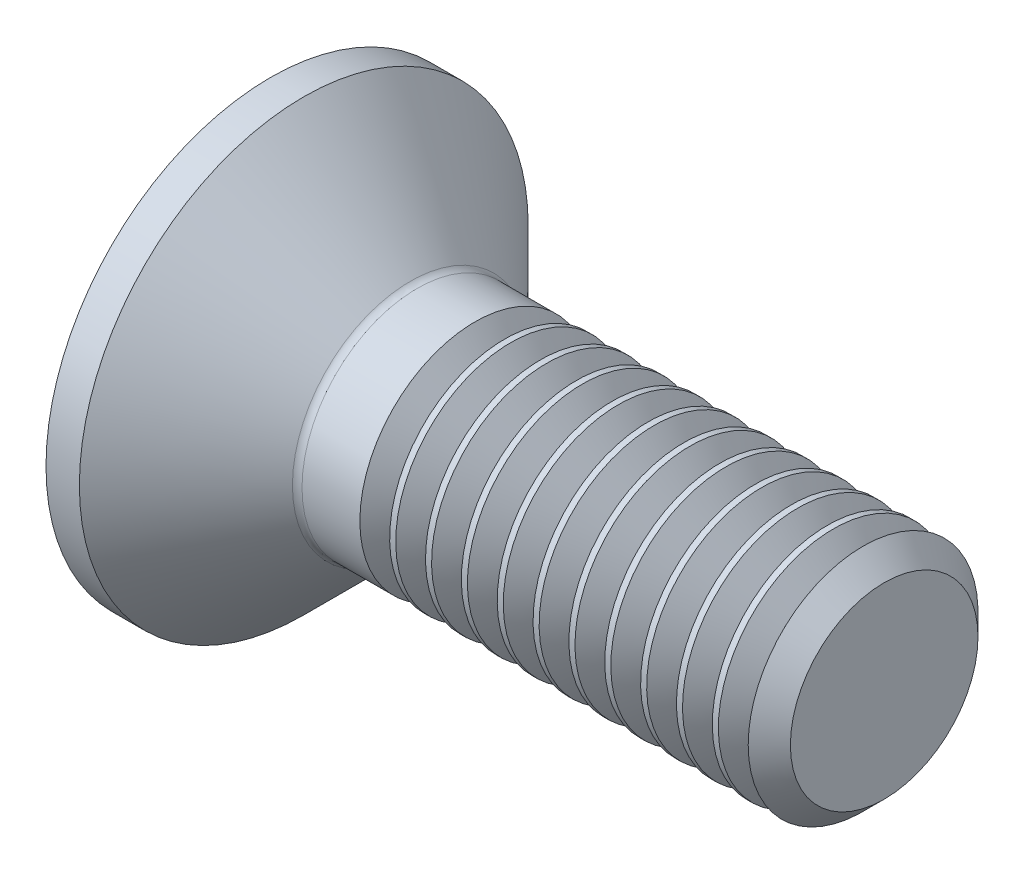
ISO-10303-21;
HEADER;
FILE_DESCRIPTION(('STEP AP214'),'2;1');
FILE_NAME('part.step','',(''),(''),'','','');
FILE_SCHEMA(('AUTOMOTIVE_DESIGN { 1 0 10303 214 1 1 1 1 }'));
ENDSEC;
DATA;
#1=APPLICATION_CONTEXT('core data for automotive mechanical design processes');
#2=APPLICATION_PROTOCOL_DEFINITION('international standard','automotive_design',2000,#1);
#3=PRODUCT_CONTEXT('',#1,'mechanical');
#4=PRODUCT('Part','Part','',(#3));
#5=PRODUCT_RELATED_PRODUCT_CATEGORY('part','',(#4));
#6=PRODUCT_DEFINITION_FORMATION('','',#4);
#7=PRODUCT_DEFINITION_CONTEXT('part definition',#1,'design');
#8=PRODUCT_DEFINITION('design','',#6,#7);
#9=PRODUCT_DEFINITION_SHAPE('','',#8);
#10=(LENGTH_UNIT() NAMED_UNIT(*) SI_UNIT(.MILLI.,.METRE.));
#11=(NAMED_UNIT(*) PLANE_ANGLE_UNIT() SI_UNIT($,.RADIAN.));
#12=(NAMED_UNIT(*) SI_UNIT($,.STERADIAN.) SOLID_ANGLE_UNIT());
#13=UNCERTAINTY_MEASURE_WITH_UNIT(LENGTH_MEASURE(1.E-05),#10,'distance_accuracy_value','');
#14=(GEOMETRIC_REPRESENTATION_CONTEXT(3) GLOBAL_UNCERTAINTY_ASSIGNED_CONTEXT((#13)) GLOBAL_UNIT_ASSIGNED_CONTEXT((#10,
#11,#12)) REPRESENTATION_CONTEXT('',''));
#15=CARTESIAN_POINT('',(0.,0.,0.));
#16=DIRECTION('',(0.,0.,1.));
#17=DIRECTION('',(1.,0.,0.));
#18=AXIS2_PLACEMENT_3D('',#15,#16,#17);
#19=CARTESIAN_POINT('',(0.,0.,0.));
#20=DIRECTION('',(-1.,0.,0.));
#21=DIRECTION('',(0.,0.,1.));
#22=AXIS2_PLACEMENT_3D('',#19,#20,#21);
#23=PLANE('',#22);
#24=CARTESIAN_POINT('',(0.,0.,0.));
#25=DIRECTION('',(-1.,0.,0.));
#26=DIRECTION('',(0.,0.,1.));
#27=AXIS2_PLACEMENT_3D('',#24,#25,#26);
#28=CIRCLE('',#27,5.85);
#29=CARTESIAN_POINT('',(0.,0.,5.85));
#30=VERTEX_POINT('',#29);
#31=EDGE_CURVE('E186',#30,#30,#28,.T.);
#32=ORIENTED_EDGE('',*,*,#31,.T.);
#33=EDGE_LOOP('',(#32));
#34=FACE_BOUND('',#33,.T.);
#35=DIRECTION('',(0.,-0.500000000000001,-0.866025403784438));
#36=VECTOR('',#35,1.);
#37=CARTESIAN_POINT('',(0.,-1.15470053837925,2.));
#38=LINE('',#37,#36);
#39=CARTESIAN_POINT('',(0.,-1.15470053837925,2.));
#40=VERTEX_POINT('',#39);
#41=CARTESIAN_POINT('',(0.,-2.3094010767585,0.));
#42=VERTEX_POINT('',#41);
#43=EDGE_CURVE('E130',#40,#42,#38,.T.);
#44=ORIENTED_EDGE('',*,*,#43,.T.);
#45=DIRECTION('',(0.,0.500000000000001,-0.866025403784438));
#46=VECTOR('',#45,1.);
#47=CARTESIAN_POINT('',(0.,-2.3094010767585,0.));
#48=LINE('',#47,#46);
#49=CARTESIAN_POINT('',(0.,-1.15470053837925,-2.));
#50=VERTEX_POINT('',#49);
#51=EDGE_CURVE('E48',#42,#50,#48,.T.);
#52=ORIENTED_EDGE('',*,*,#51,.T.);
#53=DIRECTION('',(0.,1.,0.));
#54=VECTOR('',#53,1.);
#55=CARTESIAN_POINT('',(0.,-1.15470053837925,-2.));
#56=LINE('',#55,#54);
#57=CARTESIAN_POINT('',(0.,1.15470053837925,-2.));
#58=VERTEX_POINT('',#57);
#59=EDGE_CURVE('E111',#50,#58,#56,.T.);
#60=ORIENTED_EDGE('',*,*,#59,.T.);
#61=DIRECTION('',(0.,0.5,0.866025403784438));
#62=VECTOR('',#61,1.);
#63=CARTESIAN_POINT('',(0.,1.15470053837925,-2.));
#64=LINE('',#63,#62);
#65=CARTESIAN_POINT('',(0.,2.3094010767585,0.));
#66=VERTEX_POINT('',#65);
#67=EDGE_CURVE('E119',#58,#66,#64,.T.);
#68=ORIENTED_EDGE('',*,*,#67,.T.);
#69=DIRECTION('',(0.,-0.5,0.866025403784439));
#70=VECTOR('',#69,1.);
#71=CARTESIAN_POINT('',(0.,2.3094010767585,0.));
#72=LINE('',#71,#70);
#73=CARTESIAN_POINT('',(0.,1.15470053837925,2.));
#74=VERTEX_POINT('',#73);
#75=EDGE_CURVE('E139',#66,#74,#72,.T.);
#76=ORIENTED_EDGE('',*,*,#75,.T.);
#77=DIRECTION('',(0.,-1.,0.));
#78=VECTOR('',#77,1.);
#79=CARTESIAN_POINT('',(0.,1.15470053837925,2.));
#80=LINE('',#79,#78);
#81=EDGE_CURVE('E142',#74,#40,#80,.T.);
#82=ORIENTED_EDGE('',*,*,#81,.T.);
#83=EDGE_LOOP('',(#44,#52,#60,#68,#76,#82));
#84=FACE_BOUND('',#83,.T.);
#85=ADVANCED_FACE('F33',(#34,#84),#23,.T.);
#86=CARTESIAN_POINT('',(0.,0.,0.));
#87=DIRECTION('',(-1.,0.,0.));
#88=DIRECTION('',(0.,0.,1.));
#89=AXIS2_PLACEMENT_3D('',#86,#87,#88);
#90=CYLINDRICAL_SURFACE('',#89,5.85);
#91=CARTESIAN_POINT('',(0.870000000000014,0.,0.));
#92=DIRECTION('',(-1.,0.,0.));
#93=DIRECTION('',(0.,0.,1.));
#94=AXIS2_PLACEMENT_3D('',#91,#92,#93);
#95=CIRCLE('',#94,5.85);
#96=CARTESIAN_POINT('',(0.870000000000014,0.,5.85));
#97=VERTEX_POINT('',#96);
#98=EDGE_CURVE('E183',#97,#97,#95,.T.);
#99=ORIENTED_EDGE('',*,*,#98,.T.);
#100=EDGE_LOOP('',(#99));
#101=FACE_BOUND('',#100,.T.);
#102=ORIENTED_EDGE('',*,*,#31,.F.);
#103=EDGE_LOOP('',(#102));
#104=FACE_BOUND('',#103,.T.);
#105=ADVANCED_FACE('F213',(#101,#104),#90,.T.);
#106=CARTESIAN_POINT('',(0.870000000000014,0.,0.));
#107=DIRECTION('',(-1.,0.,0.));
#108=DIRECTION('',(0.,0.,1.));
#109=AXIS2_PLACEMENT_3D('',#106,#107,#108);
#110=CONICAL_SURFACE('',#109,5.85,0.78539816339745);
#111=CARTESIAN_POINT('',(3.64677669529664,0.,0.));
#112=DIRECTION('',(-1.,0.,0.));
#113=DIRECTION('',(0.,0.,1.));
#114=AXIS2_PLACEMENT_3D('',#111,#112,#113);
#115=CIRCLE('',#114,3.07322330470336);
#116=CARTESIAN_POINT('',(3.64677669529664,0.,3.07322330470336));
#117=VERTEX_POINT('',#116);
#118=EDGE_CURVE('E41',#117,#117,#115,.T.);
#119=ORIENTED_EDGE('',*,*,#118,.T.);
#120=EDGE_LOOP('',(#119));
#121=FACE_BOUND('',#120,.T.);
#122=ORIENTED_EDGE('',*,*,#98,.F.);
#123=EDGE_LOOP('',(#122));
#124=FACE_BOUND('',#123,.T.);
#125=ADVANCED_FACE('F192',(#121,#124),#110,.T.);
#126=CARTESIAN_POINT('',(0.,0.,0.));
#127=DIRECTION('',(-1.,0.,0.));
#128=DIRECTION('',(0.,0.,1.));
#129=AXIS2_PLACEMENT_3D('',#126,#127,#128);
#130=CYLINDRICAL_SURFACE('',#129,3.);
#131=CARTESIAN_POINT('',(5.33173592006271,0.,0.));
#132=DIRECTION('',(-1.,0.,0.));
#133=DIRECTION('',(0.,-1.,0.));
#134=AXIS2_PLACEMENT_3D('',#131,#132,#133);
#135=CIRCLE('',#134,3.);
#136=CARTESIAN_POINT('',(5.33173592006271,-3.,0.));
#137=VERTEX_POINT('',#136);
#138=EDGE_CURVE('E134',#137,#137,#135,.T.);
#139=ORIENTED_EDGE('',*,*,#138,.T.);
#140=EDGE_LOOP('',(#139));
#141=FACE_BOUND('',#140,.T.);
#142=CARTESIAN_POINT('',(3.82355339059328,0.,0.));
#143=DIRECTION('',(-1.,0.,0.));
#144=DIRECTION('',(0.,0.,1.));
#145=AXIS2_PLACEMENT_3D('',#142,#143,#144);
#146=CIRCLE('',#145,3.);
#147=CARTESIAN_POINT('',(3.82355339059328,0.,3.));
#148=VERTEX_POINT('',#147);
#149=EDGE_CURVE('E11',#148,#148,#146,.F.);
#150=ORIENTED_EDGE('',*,*,#149,.T.);
#151=EDGE_LOOP('',(#150));
#152=FACE_BOUND('',#151,.T.);
#153=ADVANCED_FACE('F197',(#141,#152),#130,.T.);
#154=CARTESIAN_POINT('',(3.82355339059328,0.,0.));
#155=DIRECTION('',(-1.,0.,0.));
#156=DIRECTION('',(0.,0.,1.));
#157=AXIS2_PLACEMENT_3D('',#154,#155,#156);
#158=TOROIDAL_SURFACE('',#157,3.25,0.25);
#159=ORIENTED_EDGE('',*,*,#149,.F.);
#160=EDGE_LOOP('',(#159));
#161=FACE_BOUND('',#160,.T.);
#162=ORIENTED_EDGE('',*,*,#118,.F.);
#163=EDGE_LOOP('',(#162));
#164=FACE_BOUND('',#163,.T.);
#165=ADVANCED_FACE('F195',(#161,#164),#158,.F.);
#166=CARTESIAN_POINT('',(2.2,-2.3094010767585,0.));
#167=DIRECTION('',(0.,0.866025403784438,0.500000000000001));
#168=DIRECTION('',(0.,-0.500000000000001,0.866025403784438));
#169=AXIS2_PLACEMENT_3D('',#166,#167,#168);
#170=PLANE('',#169);
#171=ORIENTED_EDGE('',*,*,#51,.F.);
#172=DIRECTION('',(-1.,0.,0.));
#173=VECTOR('',#172,1.);
#174=CARTESIAN_POINT('',(2.2,-2.3094010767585,0.));
#175=LINE('',#174,#173);
#176=CARTESIAN_POINT('',(2.2,-2.3094010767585,0.));
#177=VERTEX_POINT('',#176);
#178=EDGE_CURVE('E164',#177,#42,#175,.T.);
#179=ORIENTED_EDGE('',*,*,#178,.F.);
#180=DIRECTION('',(0.,0.500000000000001,-0.866025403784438));
#181=VECTOR('',#180,1.);
#182=CARTESIAN_POINT('',(2.2,-2.3094010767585,0.));
#183=LINE('',#182,#181);
#184=CARTESIAN_POINT('',(2.2,-1.73205080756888,-1.));
#185=VERTEX_POINT('',#184);
#186=EDGE_CURVE('E145',#177,#185,#183,.T.);
#187=ORIENTED_EDGE('',*,*,#186,.T.);
#188=CARTESIAN_POINT('',(2.2,-1.15470053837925,-2.));
#189=VERTEX_POINT('',#188);
#190=EDGE_CURVE('E124',#185,#189,#183,.T.);
#191=ORIENTED_EDGE('',*,*,#190,.T.);
#192=DIRECTION('',(-1.,0.,0.));
#193=VECTOR('',#192,1.);
#194=CARTESIAN_POINT('',(2.2,-1.15470053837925,-2.));
#195=LINE('',#194,#193);
#196=EDGE_CURVE('E114',#189,#50,#195,.T.);
#197=ORIENTED_EDGE('',*,*,#196,.T.);
#198=EDGE_LOOP('',(#171,#179,#187,#191,#197));
#199=FACE_BOUND('',#198,.T.);
#200=ADVANCED_FACE('F121',(#199),#170,.T.);
#201=CARTESIAN_POINT('',(2.2,-1.15470053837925,-2.));
#202=DIRECTION('',(0.,0.,1.));
#203=DIRECTION('',(1.,0.,0.));
#204=AXIS2_PLACEMENT_3D('',#201,#202,#203);
#205=PLANE('',#204);
#206=ORIENTED_EDGE('',*,*,#59,.F.);
#207=ORIENTED_EDGE('',*,*,#196,.F.);
#208=DIRECTION('',(0.,1.,0.));
#209=VECTOR('',#208,1.);
#210=CARTESIAN_POINT('',(2.2,-1.15470053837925,-2.));
#211=LINE('',#210,#209);
#212=CARTESIAN_POINT('',(2.2,0.,-2.));
#213=VERTEX_POINT('',#212);
#214=EDGE_CURVE('E148',#189,#213,#211,.T.);
#215=ORIENTED_EDGE('',*,*,#214,.T.);
#216=CARTESIAN_POINT('',(2.2,1.15470053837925,-2.));
#217=VERTEX_POINT('',#216);
#218=EDGE_CURVE('E147',#213,#217,#211,.T.);
#219=ORIENTED_EDGE('',*,*,#218,.T.);
#220=DIRECTION('',(-1.,0.,0.));
#221=VECTOR('',#220,1.);
#222=CARTESIAN_POINT('',(2.2,1.15470053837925,-2.));
#223=LINE('',#222,#221);
#224=EDGE_CURVE('E116',#217,#58,#223,.T.);
#225=ORIENTED_EDGE('',*,*,#224,.T.);
#226=EDGE_LOOP('',(#206,#207,#215,#219,#225));
#227=FACE_BOUND('',#226,.T.);
#228=ADVANCED_FACE('F112',(#227),#205,.T.);
#229=CARTESIAN_POINT('',(2.2,1.15470053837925,-2.));
#230=DIRECTION('',(0.,-0.866025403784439,0.5));
#231=DIRECTION('',(0.,-0.5,-0.866025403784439));
#232=AXIS2_PLACEMENT_3D('',#229,#230,#231);
#233=PLANE('',#232);
#234=ORIENTED_EDGE('',*,*,#67,.F.);
#235=ORIENTED_EDGE('',*,*,#224,.F.);
#236=DIRECTION('',(0.,0.5,0.866025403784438));
#237=VECTOR('',#236,1.);
#238=CARTESIAN_POINT('',(2.2,1.15470053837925,-2.));
#239=LINE('',#238,#237);
#240=CARTESIAN_POINT('',(2.2,1.73205080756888,-1.));
#241=VERTEX_POINT('',#240);
#242=EDGE_CURVE('E151',#217,#241,#239,.T.);
#243=ORIENTED_EDGE('',*,*,#242,.T.);
#244=CARTESIAN_POINT('',(2.2,2.3094010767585,0.));
#245=VERTEX_POINT('',#244);
#246=EDGE_CURVE('E150',#241,#245,#239,.T.);
#247=ORIENTED_EDGE('',*,*,#246,.T.);
#248=DIRECTION('',(-1.,0.,0.));
#249=VECTOR('',#248,1.);
#250=CARTESIAN_POINT('',(2.2,2.3094010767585,0.));
#251=LINE('',#250,#249);
#252=EDGE_CURVE('E172',#245,#66,#251,.T.);
#253=ORIENTED_EDGE('',*,*,#252,.T.);
#254=EDGE_LOOP('',(#234,#235,#243,#247,#253));
#255=FACE_BOUND('',#254,.T.);
#256=ADVANCED_FACE('F355',(#255),#233,.T.);
#257=CARTESIAN_POINT('',(2.2,2.3094010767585,0.));
#258=DIRECTION('',(0.,-0.866025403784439,-0.5));
#259=DIRECTION('',(0.,0.5,-0.866025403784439));
#260=AXIS2_PLACEMENT_3D('',#257,#258,#259);
#261=PLANE('',#260);
#262=ORIENTED_EDGE('',*,*,#75,.F.);
#263=ORIENTED_EDGE('',*,*,#252,.F.);
#264=DIRECTION('',(0.,-0.5,0.866025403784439));
#265=VECTOR('',#264,1.);
#266=CARTESIAN_POINT('',(2.2,2.3094010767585,0.));
#267=LINE('',#266,#265);
#268=CARTESIAN_POINT('',(2.2,1.73205080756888,1.));
#269=VERTEX_POINT('',#268);
#270=EDGE_CURVE('E56',#245,#269,#267,.T.);
#271=ORIENTED_EDGE('',*,*,#270,.T.);
#272=CARTESIAN_POINT('',(2.2,1.15470053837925,2.));
#273=VERTEX_POINT('',#272);
#274=EDGE_CURVE('E154',#269,#273,#267,.T.);
#275=ORIENTED_EDGE('',*,*,#274,.T.);
#276=DIRECTION('',(-1.,0.,0.));
#277=VECTOR('',#276,1.);
#278=CARTESIAN_POINT('',(2.2,1.15470053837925,2.));
#279=LINE('',#278,#277);
#280=EDGE_CURVE('E169',#273,#74,#279,.T.);
#281=ORIENTED_EDGE('',*,*,#280,.T.);
#282=EDGE_LOOP('',(#262,#263,#271,#275,#281));
#283=FACE_BOUND('',#282,.T.);
#284=ADVANCED_FACE('F351',(#283),#261,.T.);
#285=CARTESIAN_POINT('',(2.2,1.15470053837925,2.));
#286=DIRECTION('',(0.,0.,-1.));
#287=DIRECTION('',(-1.,0.,0.));
#288=AXIS2_PLACEMENT_3D('',#285,#286,#287);
#289=PLANE('',#288);
#290=ORIENTED_EDGE('',*,*,#81,.F.);
#291=ORIENTED_EDGE('',*,*,#280,.F.);
#292=DIRECTION('',(0.,-1.,0.));
#293=VECTOR('',#292,1.);
#294=CARTESIAN_POINT('',(2.2,1.15470053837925,2.));
#295=LINE('',#294,#293);
#296=CARTESIAN_POINT('',(2.2,0.,2.));
#297=VERTEX_POINT('',#296);
#298=EDGE_CURVE('E157',#273,#297,#295,.T.);
#299=ORIENTED_EDGE('',*,*,#298,.T.);
#300=CARTESIAN_POINT('',(2.2,-1.15470053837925,2.));
#301=VERTEX_POINT('',#300);
#302=EDGE_CURVE('E156',#297,#301,#295,.T.);
#303=ORIENTED_EDGE('',*,*,#302,.T.);
#304=DIRECTION('',(-1.,0.,0.));
#305=VECTOR('',#304,1.);
#306=CARTESIAN_POINT('',(2.2,-1.15470053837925,2.));
#307=LINE('',#306,#305);
#308=EDGE_CURVE('E166',#301,#40,#307,.T.);
#309=ORIENTED_EDGE('',*,*,#308,.T.);
#310=EDGE_LOOP('',(#290,#291,#299,#303,#309));
#311=FACE_BOUND('',#310,.T.);
#312=ADVANCED_FACE('F347',(#311),#289,.T.);
#313=CARTESIAN_POINT('',(2.2,-1.15470053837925,2.));
#314=DIRECTION('',(0.,0.866025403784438,-0.500000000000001));
#315=DIRECTION('',(0.,0.500000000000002,0.866025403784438));
#316=AXIS2_PLACEMENT_3D('',#313,#314,#315);
#317=PLANE('',#316);
#318=ORIENTED_EDGE('',*,*,#43,.F.);
#319=ORIENTED_EDGE('',*,*,#308,.F.);
#320=DIRECTION('',(0.,-0.500000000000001,-0.866025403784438));
#321=VECTOR('',#320,1.);
#322=CARTESIAN_POINT('',(2.2,-1.15470053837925,2.));
#323=LINE('',#322,#321);
#324=CARTESIAN_POINT('',(2.2,-1.73205080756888,1.));
#325=VERTEX_POINT('',#324);
#326=EDGE_CURVE('E161',#301,#325,#323,.T.);
#327=ORIENTED_EDGE('',*,*,#326,.T.);
#328=EDGE_CURVE('E160',#325,#177,#323,.T.);
#329=ORIENTED_EDGE('',*,*,#328,.T.);
#330=ORIENTED_EDGE('',*,*,#178,.T.);
#331=EDGE_LOOP('',(#318,#319,#327,#329,#330));
#332=FACE_BOUND('',#331,.T.);
#333=ADVANCED_FACE('F342',(#332),#317,.T.);
#334=CARTESIAN_POINT('',(2.2,-2.3094010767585,0.));
#335=DIRECTION('',(-1.,0.,0.));
#336=DIRECTION('',(0.,0.,1.));
#337=AXIS2_PLACEMENT_3D('',#334,#335,#336);
#338=PLANE('',#337);
#339=CARTESIAN_POINT('',(2.2,0.,0.));
#340=DIRECTION('',(-1.,0.,0.));
#341=DIRECTION('',(0.,0.,1.));
#342=AXIS2_PLACEMENT_3D('',#339,#340,#341);
#343=CIRCLE('',#342,2.);
#344=EDGE_CURVE('E126',#325,#297,#343,.T.);
#345=ORIENTED_EDGE('',*,*,#344,.F.);
#346=ORIENTED_EDGE('',*,*,#326,.F.);
#347=ORIENTED_EDGE('',*,*,#302,.F.);
#348=EDGE_LOOP('',(#345,#346,#347));
#349=FACE_BOUND('',#348,.T.);
#350=ADVANCED_FACE('F338',(#349),#338,.T.);
#351=EDGE_CURVE('E385',#185,#325,#343,.T.);
#352=ORIENTED_EDGE('',*,*,#351,.F.);
#353=ORIENTED_EDGE('',*,*,#186,.F.);
#354=ORIENTED_EDGE('',*,*,#328,.F.);
#355=EDGE_LOOP('',(#352,#353,#354));
#356=FACE_BOUND('',#355,.T.);
#357=ADVANCED_FACE('F341',(#356),#338,.T.);
#358=EDGE_CURVE('E383',#213,#185,#343,.T.);
#359=ORIENTED_EDGE('',*,*,#358,.F.);
#360=ORIENTED_EDGE('',*,*,#214,.F.);
#361=ORIENTED_EDGE('',*,*,#190,.F.);
#362=EDGE_LOOP('',(#359,#360,#361));
#363=FACE_BOUND('',#362,.T.);
#364=ADVANCED_FACE('F389',(#363),#338,.T.);
#365=EDGE_CURVE('E382',#241,#213,#343,.T.);
#366=ORIENTED_EDGE('',*,*,#365,.F.);
#367=ORIENTED_EDGE('',*,*,#242,.F.);
#368=ORIENTED_EDGE('',*,*,#218,.F.);
#369=EDGE_LOOP('',(#366,#367,#368));
#370=FACE_BOUND('',#369,.T.);
#371=ADVANCED_FACE('F392',(#370),#338,.T.);
#372=EDGE_CURVE('E180',#269,#241,#343,.T.);
#373=ORIENTED_EDGE('',*,*,#372,.F.);
#374=ORIENTED_EDGE('',*,*,#270,.F.);
#375=ORIENTED_EDGE('',*,*,#246,.F.);
#376=EDGE_LOOP('',(#373,#374,#375));
#377=FACE_BOUND('',#376,.T.);
#378=ADVANCED_FACE('F365',(#377),#338,.T.);
#379=EDGE_CURVE('E176',#297,#269,#343,.T.);
#380=ORIENTED_EDGE('',*,*,#379,.F.);
#381=ORIENTED_EDGE('',*,*,#298,.F.);
#382=ORIENTED_EDGE('',*,*,#274,.F.);
#383=EDGE_LOOP('',(#380,#381,#382));
#384=FACE_BOUND('',#383,.T.);
#385=ADVANCED_FACE('F344',(#384),#338,.T.);
#386=CARTESIAN_POINT('',(2.2,0.,0.));
#387=DIRECTION('',(-1.,0.,0.));
#388=DIRECTION('',(0.,0.,1.));
#389=AXIS2_PLACEMENT_3D('',#386,#387,#388);
#390=CONICAL_SURFACE('',#389,2.,1.04719755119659);
#391=CARTESIAN_POINT('',(3.35470053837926,0.,0.));
#392=VERTEX_POINT('',#391);
#393=VERTEX_LOOP('',#392);
#394=FACE_BOUND('',#393,.T.);
#395=ORIENTED_EDGE('',*,*,#379,.T.);
#396=ORIENTED_EDGE('',*,*,#372,.T.);
#397=ORIENTED_EDGE('',*,*,#365,.T.);
#398=ORIENTED_EDGE('',*,*,#358,.T.);
#399=ORIENTED_EDGE('',*,*,#351,.T.);
#400=ORIENTED_EDGE('',*,*,#344,.T.);
#401=EDGE_LOOP('',(#395,#396,#397,#398,#399,#400));
#402=FACE_BOUND('',#401,.T.);
#403=ADVANCED_FACE('F336',(#394,#402),#390,.F.);
#404=CARTESIAN_POINT('',(6.10826607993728,0.,0.));
#405=DIRECTION('',(1.,0.,0.));
#406=DIRECTION('',(0.,1.,0.));
#407=AXIS2_PLACEMENT_3D('',#404,#405,#406);
#408=CONICAL_SURFACE('',#407,3.,0.959931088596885);
#409=CARTESIAN_POINT('',(5.720001,0.,0.));
#410=DIRECTION('',(-1.,0.,0.));
#411=DIRECTION('',(0.,-1.,0.));
#412=AXIS2_PLACEMENT_3D('',#409,#410,#411);
#413=CIRCLE('',#412,2.4455);
#414=CARTESIAN_POINT('',(5.720001,-2.4455,0.));
#415=VERTEX_POINT('',#414);
#416=EDGE_CURVE('E768',#415,#415,#413,.T.);
#417=ORIENTED_EDGE('',*,*,#416,.F.);
#418=EDGE_LOOP('',(#417));
#419=FACE_BOUND('',#418,.T.);
#420=CARTESIAN_POINT('',(6.10826607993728,0.,0.));
#421=DIRECTION('',(-1.,0.,0.));
#422=DIRECTION('',(0.,-1.,0.));
#423=AXIS2_PLACEMENT_3D('',#420,#421,#422);
#424=CIRCLE('',#423,3.);
#425=CARTESIAN_POINT('',(6.10826607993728,-3.,0.));
#426=VERTEX_POINT('',#425);
#427=EDGE_CURVE('E131',#426,#426,#424,.T.);
#428=ORIENTED_EDGE('',*,*,#427,.T.);
#429=EDGE_LOOP('',(#428));
#430=FACE_BOUND('',#429,.T.);
#431=ADVANCED_FACE('F332',(#419,#430),#408,.T.);
#432=CARTESIAN_POINT('',(5.720001,0.,0.));
#433=DIRECTION('',(-1.,0.,0.));
#434=DIRECTION('',(0.,-1.,0.));
#435=AXIS2_PLACEMENT_3D('',#432,#433,#434);
#436=CONICAL_SURFACE('',#435,2.4455,0.959931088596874);
#437=ORIENTED_EDGE('',*,*,#138,.F.);
#438=EDGE_LOOP('',(#437));
#439=FACE_BOUND('',#438,.T.);
#440=ORIENTED_EDGE('',*,*,#416,.T.);
#441=EDGE_LOOP('',(#440));
#442=FACE_BOUND('',#441,.T.);
#443=ADVANCED_FACE('F329',(#439,#442),#436,.T.);
#444=CARTESIAN_POINT('',(6.26628137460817,0.,0.));
#445=DIRECTION('',(-1.,0.,0.));
#446=DIRECTION('',(0.,-1.,0.));
#447=AXIS2_PLACEMENT_3D('',#444,#445,#446);
#448=CIRCLE('',#447,3.);
#449=CARTESIAN_POINT('',(6.26628137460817,-3.,0.));
#450=VERTEX_POINT('',#449);
#451=EDGE_CURVE('E762',#450,#450,#448,.T.);
#452=ORIENTED_EDGE('',*,*,#451,.T.);
#453=EDGE_LOOP('',(#452));
#454=FACE_BOUND('',#453,.T.);
#455=ORIENTED_EDGE('',*,*,#427,.F.);
#456=EDGE_LOOP('',(#455));
#457=FACE_BOUND('',#456,.T.);
#458=ADVANCED_FACE('F208',(#454,#457),#130,.T.);
#459=CARTESIAN_POINT('',(7.04281153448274,0.,0.));
#460=DIRECTION('',(1.,0.,0.));
#461=DIRECTION('',(0.,1.,0.));
#462=AXIS2_PLACEMENT_3D('',#459,#460,#461);
#463=CONICAL_SURFACE('',#462,3.,0.959931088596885);
#464=CARTESIAN_POINT('',(6.65454645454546,0.,0.));
#465=DIRECTION('',(-1.,0.,0.));
#466=DIRECTION('',(0.,-1.,0.));
#467=AXIS2_PLACEMENT_3D('',#464,#465,#466);
#468=CIRCLE('',#467,2.4455);
#469=CARTESIAN_POINT('',(6.65454645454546,-2.4455,0.));
#470=VERTEX_POINT('',#469);
#471=EDGE_CURVE('E759',#470,#470,#468,.T.);
#472=ORIENTED_EDGE('',*,*,#471,.F.);
#473=EDGE_LOOP('',(#472));
#474=FACE_BOUND('',#473,.T.);
#475=CARTESIAN_POINT('',(7.04281153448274,0.,0.));
#476=DIRECTION('',(-1.,0.,0.));
#477=DIRECTION('',(0.,-1.,0.));
#478=AXIS2_PLACEMENT_3D('',#475,#476,#477);
#479=CIRCLE('',#478,3.);
#480=CARTESIAN_POINT('',(7.04281153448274,-3.,0.));
#481=VERTEX_POINT('',#480);
#482=EDGE_CURVE('E765',#481,#481,#479,.T.);
#483=ORIENTED_EDGE('',*,*,#482,.T.);
#484=EDGE_LOOP('',(#483));
#485=FACE_BOUND('',#484,.T.);
#486=ADVANCED_FACE('F324',(#474,#485),#463,.T.);
#487=CARTESIAN_POINT('',(6.65454645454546,0.,0.));
#488=DIRECTION('',(-1.,0.,0.));
#489=DIRECTION('',(0.,-1.,0.));
#490=AXIS2_PLACEMENT_3D('',#487,#488,#489);
#491=CONICAL_SURFACE('',#490,2.4455,0.959931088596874);
#492=ORIENTED_EDGE('',*,*,#451,.F.);
#493=EDGE_LOOP('',(#492));
#494=FACE_BOUND('',#493,.T.);
#495=ORIENTED_EDGE('',*,*,#471,.T.);
#496=EDGE_LOOP('',(#495));
#497=FACE_BOUND('',#496,.T.);
#498=ADVANCED_FACE('F321',(#494,#497),#491,.T.);
#499=CARTESIAN_POINT('',(7.20082682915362,0.,0.));
#500=DIRECTION('',(-1.,0.,0.));
#501=DIRECTION('',(0.,-1.,0.));
#502=AXIS2_PLACEMENT_3D('',#499,#500,#501);
#503=CIRCLE('',#502,3.);
#504=CARTESIAN_POINT('',(7.20082682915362,-3.,0.));
#505=VERTEX_POINT('',#504);
#506=EDGE_CURVE('E753',#505,#505,#503,.T.);
#507=ORIENTED_EDGE('',*,*,#506,.T.);
#508=EDGE_LOOP('',(#507));
#509=FACE_BOUND('',#508,.T.);
#510=ORIENTED_EDGE('',*,*,#482,.F.);
#511=EDGE_LOOP('',(#510));
#512=FACE_BOUND('',#511,.T.);
#513=ADVANCED_FACE('F319',(#509,#512),#130,.T.);
#514=CARTESIAN_POINT('',(7.97735698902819,0.,0.));
#515=DIRECTION('',(1.,0.,0.));
#516=DIRECTION('',(0.,1.,0.));
#517=AXIS2_PLACEMENT_3D('',#514,#515,#516);
#518=CONICAL_SURFACE('',#517,3.,0.959931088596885);
#519=CARTESIAN_POINT('',(7.58909190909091,0.,0.));
#520=DIRECTION('',(-1.,0.,0.));
#521=DIRECTION('',(0.,-1.,0.));
#522=AXIS2_PLACEMENT_3D('',#519,#520,#521);
#523=CIRCLE('',#522,2.4455);
#524=CARTESIAN_POINT('',(7.58909190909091,-2.4455,0.));
#525=VERTEX_POINT('',#524);
#526=EDGE_CURVE('E750',#525,#525,#523,.T.);
#527=ORIENTED_EDGE('',*,*,#526,.F.);
#528=EDGE_LOOP('',(#527));
#529=FACE_BOUND('',#528,.T.);
#530=CARTESIAN_POINT('',(7.97735698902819,0.,0.));
#531=DIRECTION('',(-1.,0.,0.));
#532=DIRECTION('',(0.,-1.,0.));
#533=AXIS2_PLACEMENT_3D('',#530,#531,#532);
#534=CIRCLE('',#533,3.);
#535=CARTESIAN_POINT('',(7.97735698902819,-3.,0.));
#536=VERTEX_POINT('',#535);
#537=EDGE_CURVE('E756',#536,#536,#534,.T.);
#538=ORIENTED_EDGE('',*,*,#537,.T.);
#539=EDGE_LOOP('',(#538));
#540=FACE_BOUND('',#539,.T.);
#541=ADVANCED_FACE('F315',(#529,#540),#518,.T.);
#542=CARTESIAN_POINT('',(7.58909190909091,0.,0.));
#543=DIRECTION('',(-1.,0.,0.));
#544=DIRECTION('',(0.,-1.,0.));
#545=AXIS2_PLACEMENT_3D('',#542,#543,#544);
#546=CONICAL_SURFACE('',#545,2.4455,0.959931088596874);
#547=ORIENTED_EDGE('',*,*,#506,.F.);
#548=EDGE_LOOP('',(#547));
#549=FACE_BOUND('',#548,.T.);
#550=ORIENTED_EDGE('',*,*,#526,.T.);
#551=EDGE_LOOP('',(#550));
#552=FACE_BOUND('',#551,.T.);
#553=ADVANCED_FACE('F312',(#549,#552),#546,.T.);
#554=CARTESIAN_POINT('',(8.13537228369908,0.,0.));
#555=DIRECTION('',(-1.,0.,0.));
#556=DIRECTION('',(0.,-1.,0.));
#557=AXIS2_PLACEMENT_3D('',#554,#555,#556);
#558=CIRCLE('',#557,3.);
#559=CARTESIAN_POINT('',(8.13537228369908,-3.,0.));
#560=VERTEX_POINT('',#559);
#561=EDGE_CURVE('E744',#560,#560,#558,.T.);
#562=ORIENTED_EDGE('',*,*,#561,.T.);
#563=EDGE_LOOP('',(#562));
#564=FACE_BOUND('',#563,.T.);
#565=ORIENTED_EDGE('',*,*,#537,.F.);
#566=EDGE_LOOP('',(#565));
#567=FACE_BOUND('',#566,.T.);
#568=ADVANCED_FACE('F310',(#564,#567),#130,.T.);
#569=CARTESIAN_POINT('',(8.91190244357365,0.,0.));
#570=DIRECTION('',(1.,0.,0.));
#571=DIRECTION('',(0.,1.,0.));
#572=AXIS2_PLACEMENT_3D('',#569,#570,#571);
#573=CONICAL_SURFACE('',#572,3.,0.959931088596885);
#574=CARTESIAN_POINT('',(8.52363736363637,0.,0.));
#575=DIRECTION('',(-1.,0.,0.));
#576=DIRECTION('',(0.,-1.,0.));
#577=AXIS2_PLACEMENT_3D('',#574,#575,#576);
#578=CIRCLE('',#577,2.4455);
#579=CARTESIAN_POINT('',(8.52363736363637,-2.4455,0.));
#580=VERTEX_POINT('',#579);
#581=EDGE_CURVE('E741',#580,#580,#578,.T.);
#582=ORIENTED_EDGE('',*,*,#581,.F.);
#583=EDGE_LOOP('',(#582));
#584=FACE_BOUND('',#583,.T.);
#585=CARTESIAN_POINT('',(8.91190244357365,0.,0.));
#586=DIRECTION('',(-1.,0.,0.));
#587=DIRECTION('',(0.,-1.,0.));
#588=AXIS2_PLACEMENT_3D('',#585,#586,#587);
#589=CIRCLE('',#588,3.);
#590=CARTESIAN_POINT('',(8.91190244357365,-3.,0.));
#591=VERTEX_POINT('',#590);
#592=EDGE_CURVE('E747',#591,#591,#589,.T.);
#593=ORIENTED_EDGE('',*,*,#592,.T.);
#594=EDGE_LOOP('',(#593));
#595=FACE_BOUND('',#594,.T.);
#596=ADVANCED_FACE('F306',(#584,#595),#573,.T.);
#597=CARTESIAN_POINT('',(8.52363736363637,0.,0.));
#598=DIRECTION('',(-1.,0.,0.));
#599=DIRECTION('',(0.,-1.,0.));
#600=AXIS2_PLACEMENT_3D('',#597,#598,#599);
#601=CONICAL_SURFACE('',#600,2.4455,0.959931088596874);
#602=ORIENTED_EDGE('',*,*,#561,.F.);
#603=EDGE_LOOP('',(#602));
#604=FACE_BOUND('',#603,.T.);
#605=ORIENTED_EDGE('',*,*,#581,.T.);
#606=EDGE_LOOP('',(#605));
#607=FACE_BOUND('',#606,.T.);
#608=ADVANCED_FACE('F303',(#604,#607),#601,.T.);
#609=CARTESIAN_POINT('',(9.06991773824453,0.,0.));
#610=DIRECTION('',(-1.,0.,0.));
#611=DIRECTION('',(0.,-1.,0.));
#612=AXIS2_PLACEMENT_3D('',#609,#610,#611);
#613=CIRCLE('',#612,3.);
#614=CARTESIAN_POINT('',(9.06991773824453,-3.,0.));
#615=VERTEX_POINT('',#614);
#616=EDGE_CURVE('E735',#615,#615,#613,.T.);
#617=ORIENTED_EDGE('',*,*,#616,.T.);
#618=EDGE_LOOP('',(#617));
#619=FACE_BOUND('',#618,.T.);
#620=ORIENTED_EDGE('',*,*,#592,.F.);
#621=EDGE_LOOP('',(#620));
#622=FACE_BOUND('',#621,.T.);
#623=ADVANCED_FACE('F301',(#619,#622),#130,.T.);
#624=CARTESIAN_POINT('',(9.8464478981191,0.,0.));
#625=DIRECTION('',(1.,0.,0.));
#626=DIRECTION('',(0.,1.,0.));
#627=AXIS2_PLACEMENT_3D('',#624,#625,#626);
#628=CONICAL_SURFACE('',#627,3.,0.959931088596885);
#629=CARTESIAN_POINT('',(9.45818281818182,0.,0.));
#630=DIRECTION('',(-1.,0.,0.));
#631=DIRECTION('',(0.,-1.,0.));
#632=AXIS2_PLACEMENT_3D('',#629,#630,#631);
#633=CIRCLE('',#632,2.4455);
#634=CARTESIAN_POINT('',(9.45818281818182,-2.4455,0.));
#635=VERTEX_POINT('',#634);
#636=EDGE_CURVE('E732',#635,#635,#633,.T.);
#637=ORIENTED_EDGE('',*,*,#636,.F.);
#638=EDGE_LOOP('',(#637));
#639=FACE_BOUND('',#638,.T.);
#640=CARTESIAN_POINT('',(9.8464478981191,0.,0.));
#641=DIRECTION('',(-1.,0.,0.));
#642=DIRECTION('',(0.,-1.,0.));
#643=AXIS2_PLACEMENT_3D('',#640,#641,#642);
#644=CIRCLE('',#643,3.);
#645=CARTESIAN_POINT('',(9.8464478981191,-3.,0.));
#646=VERTEX_POINT('',#645);
#647=EDGE_CURVE('E738',#646,#646,#644,.T.);
#648=ORIENTED_EDGE('',*,*,#647,.T.);
#649=EDGE_LOOP('',(#648));
#650=FACE_BOUND('',#649,.T.);
#651=ADVANCED_FACE('F297',(#639,#650),#628,.T.);
#652=CARTESIAN_POINT('',(9.45818281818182,0.,0.));
#653=DIRECTION('',(-1.,0.,0.));
#654=DIRECTION('',(0.,-1.,0.));
#655=AXIS2_PLACEMENT_3D('',#652,#653,#654);
#656=CONICAL_SURFACE('',#655,2.4455,0.959931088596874);
#657=ORIENTED_EDGE('',*,*,#616,.F.);
#658=EDGE_LOOP('',(#657));
#659=FACE_BOUND('',#658,.T.);
#660=ORIENTED_EDGE('',*,*,#636,.T.);
#661=EDGE_LOOP('',(#660));
#662=FACE_BOUND('',#661,.T.);
#663=ADVANCED_FACE('F294',(#659,#662),#656,.T.);
#664=CARTESIAN_POINT('',(10.00446319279,0.,0.));
#665=DIRECTION('',(-1.,0.,0.));
#666=DIRECTION('',(0.,-1.,0.));
#667=AXIS2_PLACEMENT_3D('',#664,#665,#666);
#668=CIRCLE('',#667,3.);
#669=CARTESIAN_POINT('',(10.00446319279,-3.,0.));
#670=VERTEX_POINT('',#669);
#671=EDGE_CURVE('E726',#670,#670,#668,.T.);
#672=ORIENTED_EDGE('',*,*,#671,.T.);
#673=EDGE_LOOP('',(#672));
#674=FACE_BOUND('',#673,.T.);
#675=ORIENTED_EDGE('',*,*,#647,.F.);
#676=EDGE_LOOP('',(#675));
#677=FACE_BOUND('',#676,.T.);
#678=ADVANCED_FACE('F292',(#674,#677),#130,.T.);
#679=CARTESIAN_POINT('',(10.7809933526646,0.,0.));
#680=DIRECTION('',(1.,0.,0.));
#681=DIRECTION('',(0.,1.,0.));
#682=AXIS2_PLACEMENT_3D('',#679,#680,#681);
#683=CONICAL_SURFACE('',#682,3.,0.959931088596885);
#684=CARTESIAN_POINT('',(10.3927282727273,0.,0.));
#685=DIRECTION('',(-1.,0.,0.));
#686=DIRECTION('',(0.,-1.,0.));
#687=AXIS2_PLACEMENT_3D('',#684,#685,#686);
#688=CIRCLE('',#687,2.4455);
#689=CARTESIAN_POINT('',(10.3927282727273,-2.4455,0.));
#690=VERTEX_POINT('',#689);
#691=EDGE_CURVE('E723',#690,#690,#688,.T.);
#692=ORIENTED_EDGE('',*,*,#691,.F.);
#693=EDGE_LOOP('',(#692));
#694=FACE_BOUND('',#693,.T.);
#695=CARTESIAN_POINT('',(10.7809933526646,0.,0.));
#696=DIRECTION('',(-1.,0.,0.));
#697=DIRECTION('',(0.,-1.,0.));
#698=AXIS2_PLACEMENT_3D('',#695,#696,#697);
#699=CIRCLE('',#698,3.);
#700=CARTESIAN_POINT('',(10.7809933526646,-3.,0.));
#701=VERTEX_POINT('',#700);
#702=EDGE_CURVE('E729',#701,#701,#699,.T.);
#703=ORIENTED_EDGE('',*,*,#702,.T.);
#704=EDGE_LOOP('',(#703));
#705=FACE_BOUND('',#704,.T.);
#706=ADVANCED_FACE('F288',(#694,#705),#683,.T.);
#707=CARTESIAN_POINT('',(10.3927282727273,0.,0.));
#708=DIRECTION('',(-1.,0.,0.));
#709=DIRECTION('',(0.,-1.,0.));
#710=AXIS2_PLACEMENT_3D('',#707,#708,#709);
#711=CONICAL_SURFACE('',#710,2.4455,0.959931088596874);
#712=ORIENTED_EDGE('',*,*,#671,.F.);
#713=EDGE_LOOP('',(#712));
#714=FACE_BOUND('',#713,.T.);
#715=ORIENTED_EDGE('',*,*,#691,.T.);
#716=EDGE_LOOP('',(#715));
#717=FACE_BOUND('',#716,.T.);
#718=ADVANCED_FACE('F285',(#714,#717),#711,.T.);
#719=CARTESIAN_POINT('',(10.9390086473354,0.,0.));
#720=DIRECTION('',(-1.,0.,0.));
#721=DIRECTION('',(0.,-1.,0.));
#722=AXIS2_PLACEMENT_3D('',#719,#720,#721);
#723=CIRCLE('',#722,3.);
#724=CARTESIAN_POINT('',(10.9390086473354,-3.,0.));
#725=VERTEX_POINT('',#724);
#726=EDGE_CURVE('E717',#725,#725,#723,.T.);
#727=ORIENTED_EDGE('',*,*,#726,.T.);
#728=EDGE_LOOP('',(#727));
#729=FACE_BOUND('',#728,.T.);
#730=ORIENTED_EDGE('',*,*,#702,.F.);
#731=EDGE_LOOP('',(#730));
#732=FACE_BOUND('',#731,.T.);
#733=ADVANCED_FACE('F283',(#729,#732),#130,.T.);
#734=CARTESIAN_POINT('',(11.71553880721,0.,0.));
#735=DIRECTION('',(1.,0.,0.));
#736=DIRECTION('',(0.,1.,0.));
#737=AXIS2_PLACEMENT_3D('',#734,#735,#736);
#738=CONICAL_SURFACE('',#737,3.,0.959931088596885);
#739=CARTESIAN_POINT('',(11.3272737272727,0.,0.));
#740=DIRECTION('',(-1.,0.,0.));
#741=DIRECTION('',(0.,-1.,0.));
#742=AXIS2_PLACEMENT_3D('',#739,#740,#741);
#743=CIRCLE('',#742,2.4455);
#744=CARTESIAN_POINT('',(11.3272737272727,-2.4455,0.));
#745=VERTEX_POINT('',#744);
#746=EDGE_CURVE('E714',#745,#745,#743,.T.);
#747=ORIENTED_EDGE('',*,*,#746,.F.);
#748=EDGE_LOOP('',(#747));
#749=FACE_BOUND('',#748,.T.);
#750=CARTESIAN_POINT('',(11.71553880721,0.,0.));
#751=DIRECTION('',(-1.,0.,0.));
#752=DIRECTION('',(0.,-1.,0.));
#753=AXIS2_PLACEMENT_3D('',#750,#751,#752);
#754=CIRCLE('',#753,3.);
#755=CARTESIAN_POINT('',(11.71553880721,-3.,0.));
#756=VERTEX_POINT('',#755);
#757=EDGE_CURVE('E720',#756,#756,#754,.T.);
#758=ORIENTED_EDGE('',*,*,#757,.T.);
#759=EDGE_LOOP('',(#758));
#760=FACE_BOUND('',#759,.T.);
#761=ADVANCED_FACE('F279',(#749,#760),#738,.T.);
#762=CARTESIAN_POINT('',(11.3272737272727,0.,0.));
#763=DIRECTION('',(-1.,0.,0.));
#764=DIRECTION('',(0.,-1.,0.));
#765=AXIS2_PLACEMENT_3D('',#762,#763,#764);
#766=CONICAL_SURFACE('',#765,2.4455,0.959931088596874);
#767=ORIENTED_EDGE('',*,*,#726,.F.);
#768=EDGE_LOOP('',(#767));
#769=FACE_BOUND('',#768,.T.);
#770=ORIENTED_EDGE('',*,*,#746,.T.);
#771=EDGE_LOOP('',(#770));
#772=FACE_BOUND('',#771,.T.);
#773=ADVANCED_FACE('F276',(#769,#772),#766,.T.);
#774=CARTESIAN_POINT('',(11.8735541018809,0.,0.));
#775=DIRECTION('',(-1.,0.,0.));
#776=DIRECTION('',(0.,-1.,0.));
#777=AXIS2_PLACEMENT_3D('',#774,#775,#776);
#778=CIRCLE('',#777,3.);
#779=CARTESIAN_POINT('',(11.8735541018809,-3.,0.));
#780=VERTEX_POINT('',#779);
#781=EDGE_CURVE('E708',#780,#780,#778,.T.);
#782=ORIENTED_EDGE('',*,*,#781,.T.);
#783=EDGE_LOOP('',(#782));
#784=FACE_BOUND('',#783,.T.);
#785=ORIENTED_EDGE('',*,*,#757,.F.);
#786=EDGE_LOOP('',(#785));
#787=FACE_BOUND('',#786,.T.);
#788=ADVANCED_FACE('F274',(#784,#787),#130,.T.);
#789=CARTESIAN_POINT('',(12.6500842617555,0.,0.));
#790=DIRECTION('',(1.,0.,0.));
#791=DIRECTION('',(0.,1.,0.));
#792=AXIS2_PLACEMENT_3D('',#789,#790,#791);
#793=CONICAL_SURFACE('',#792,3.,0.959931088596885);
#794=CARTESIAN_POINT('',(12.2618191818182,0.,0.));
#795=DIRECTION('',(-1.,0.,0.));
#796=DIRECTION('',(0.,-1.,0.));
#797=AXIS2_PLACEMENT_3D('',#794,#795,#796);
#798=CIRCLE('',#797,2.4455);
#799=CARTESIAN_POINT('',(12.2618191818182,-2.4455,0.));
#800=VERTEX_POINT('',#799);
#801=EDGE_CURVE('E705',#800,#800,#798,.T.);
#802=ORIENTED_EDGE('',*,*,#801,.F.);
#803=EDGE_LOOP('',(#802));
#804=FACE_BOUND('',#803,.T.);
#805=CARTESIAN_POINT('',(12.6500842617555,0.,0.));
#806=DIRECTION('',(-1.,0.,0.));
#807=DIRECTION('',(0.,-1.,0.));
#808=AXIS2_PLACEMENT_3D('',#805,#806,#807);
#809=CIRCLE('',#808,3.);
#810=CARTESIAN_POINT('',(12.6500842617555,-3.,0.));
#811=VERTEX_POINT('',#810);
#812=EDGE_CURVE('E711',#811,#811,#809,.T.);
#813=ORIENTED_EDGE('',*,*,#812,.T.);
#814=EDGE_LOOP('',(#813));
#815=FACE_BOUND('',#814,.T.);
#816=ADVANCED_FACE('F270',(#804,#815),#793,.T.);
#817=CARTESIAN_POINT('',(12.2618191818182,0.,0.));
#818=DIRECTION('',(-1.,0.,0.));
#819=DIRECTION('',(0.,-1.,0.));
#820=AXIS2_PLACEMENT_3D('',#817,#818,#819);
#821=CONICAL_SURFACE('',#820,2.4455,0.959931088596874);
#822=ORIENTED_EDGE('',*,*,#781,.F.);
#823=EDGE_LOOP('',(#822));
#824=FACE_BOUND('',#823,.T.);
#825=ORIENTED_EDGE('',*,*,#801,.T.);
#826=EDGE_LOOP('',(#825));
#827=FACE_BOUND('',#826,.T.);
#828=ADVANCED_FACE('F267',(#824,#827),#821,.T.);
#829=CARTESIAN_POINT('',(12.8080995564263,0.,0.));
#830=DIRECTION('',(-1.,0.,0.));
#831=DIRECTION('',(0.,-1.,0.));
#832=AXIS2_PLACEMENT_3D('',#829,#830,#831);
#833=CIRCLE('',#832,3.);
#834=CARTESIAN_POINT('',(12.8080995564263,-3.,0.));
#835=VERTEX_POINT('',#834);
#836=EDGE_CURVE('E693',#835,#835,#833,.T.);
#837=ORIENTED_EDGE('',*,*,#836,.T.);
#838=EDGE_LOOP('',(#837));
#839=FACE_BOUND('',#838,.T.);
#840=ORIENTED_EDGE('',*,*,#812,.F.);
#841=EDGE_LOOP('',(#840));
#842=FACE_BOUND('',#841,.T.);
#843=ADVANCED_FACE('F265',(#839,#842),#130,.T.);
#844=CARTESIAN_POINT('',(13.5846297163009,0.,0.));
#845=DIRECTION('',(1.,0.,0.));
#846=DIRECTION('',(0.,1.,0.));
#847=AXIS2_PLACEMENT_3D('',#844,#845,#846);
#848=CONICAL_SURFACE('',#847,3.,0.959931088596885);
#849=CARTESIAN_POINT('',(13.1963646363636,0.,0.));
#850=DIRECTION('',(-1.,0.,0.));
#851=DIRECTION('',(0.,-1.,0.));
#852=AXIS2_PLACEMENT_3D('',#849,#850,#851);
#853=CIRCLE('',#852,2.4455);
#854=CARTESIAN_POINT('',(13.1963646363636,-2.4455,0.));
#855=VERTEX_POINT('',#854);
#856=EDGE_CURVE('E689',#855,#855,#853,.T.);
#857=ORIENTED_EDGE('',*,*,#856,.F.);
#858=EDGE_LOOP('',(#857));
#859=FACE_BOUND('',#858,.T.);
#860=CARTESIAN_POINT('',(13.5846297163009,0.,0.));
#861=DIRECTION('',(-1.,0.,0.));
#862=DIRECTION('',(0.,-1.,0.));
#863=AXIS2_PLACEMENT_3D('',#860,#861,#862);
#864=CIRCLE('',#863,3.);
#865=CARTESIAN_POINT('',(13.5846297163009,-3.,0.));
#866=VERTEX_POINT('',#865);
#867=EDGE_CURVE('E702',#866,#866,#864,.T.);
#868=ORIENTED_EDGE('',*,*,#867,.T.);
#869=EDGE_LOOP('',(#868));
#870=FACE_BOUND('',#869,.T.);
#871=ADVANCED_FACE('F261',(#859,#870),#848,.T.);
#872=CARTESIAN_POINT('',(13.1963646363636,0.,0.));
#873=DIRECTION('',(-1.,0.,0.));
#874=DIRECTION('',(0.,-1.,0.));
#875=AXIS2_PLACEMENT_3D('',#872,#873,#874);
#876=CONICAL_SURFACE('',#875,2.4455,0.959931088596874);
#877=ORIENTED_EDGE('',*,*,#836,.F.);
#878=EDGE_LOOP('',(#877));
#879=FACE_BOUND('',#878,.T.);
#880=ORIENTED_EDGE('',*,*,#856,.T.);
#881=EDGE_LOOP('',(#880));
#882=FACE_BOUND('',#881,.T.);
#883=ADVANCED_FACE('F258',(#879,#882),#876,.T.);
#884=CARTESIAN_POINT('',(13.7426450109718,0.,0.));
#885=DIRECTION('',(-1.,0.,0.));
#886=DIRECTION('',(0.,-1.,0.));
#887=AXIS2_PLACEMENT_3D('',#884,#885,#886);
#888=CIRCLE('',#887,3.);
#889=CARTESIAN_POINT('',(13.7426450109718,-3.,0.));
#890=VERTEX_POINT('',#889);
#891=EDGE_CURVE('E690',#890,#890,#888,.T.);
#892=ORIENTED_EDGE('',*,*,#891,.T.);
#893=EDGE_LOOP('',(#892));
#894=FACE_BOUND('',#893,.T.);
#895=ORIENTED_EDGE('',*,*,#867,.F.);
#896=EDGE_LOOP('',(#895));
#897=FACE_BOUND('',#896,.T.);
#898=ADVANCED_FACE('F256',(#894,#897),#130,.T.);
#899=CARTESIAN_POINT('',(14.5191751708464,0.,0.));
#900=DIRECTION('',(1.,0.,0.));
#901=DIRECTION('',(0.,1.,0.));
#902=AXIS2_PLACEMENT_3D('',#899,#900,#901);
#903=CONICAL_SURFACE('',#902,3.,0.959931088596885);
#904=CARTESIAN_POINT('',(14.1309100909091,0.,0.));
#905=DIRECTION('',(-1.,0.,0.));
#906=DIRECTION('',(0.,-1.,0.));
#907=AXIS2_PLACEMENT_3D('',#904,#905,#906);
#908=CIRCLE('',#907,2.4455);
#909=CARTESIAN_POINT('',(14.1309100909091,-2.4455,0.));
#910=VERTEX_POINT('',#909);
#911=EDGE_CURVE('E696',#910,#910,#908,.T.);
#912=ORIENTED_EDGE('',*,*,#911,.F.);
#913=EDGE_LOOP('',(#912));
#914=FACE_BOUND('',#913,.T.);
#915=CARTESIAN_POINT('',(14.5191751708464,0.,0.));
#916=DIRECTION('',(-1.,0.,0.));
#917=DIRECTION('',(0.,-1.,0.));
#918=AXIS2_PLACEMENT_3D('',#915,#916,#917);
#919=CIRCLE('',#918,3.);
#920=CARTESIAN_POINT('',(14.5191751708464,-3.,0.));
#921=VERTEX_POINT('',#920);
#922=EDGE_CURVE('E687',#921,#921,#919,.T.);
#923=ORIENTED_EDGE('',*,*,#922,.T.);
#924=EDGE_LOOP('',(#923));
#925=FACE_BOUND('',#924,.T.);
#926=ADVANCED_FACE('F252',(#914,#925),#903,.T.);
#927=CARTESIAN_POINT('',(14.1309100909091,0.,0.));
#928=DIRECTION('',(-1.,0.,0.));
#929=DIRECTION('',(0.,-1.,0.));
#930=AXIS2_PLACEMENT_3D('',#927,#928,#929);
#931=CONICAL_SURFACE('',#930,2.4455,0.959931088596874);
#932=ORIENTED_EDGE('',*,*,#891,.F.);
#933=EDGE_LOOP('',(#932));
#934=FACE_BOUND('',#933,.T.);
#935=ORIENTED_EDGE('',*,*,#911,.T.);
#936=EDGE_LOOP('',(#935));
#937=FACE_BOUND('',#936,.T.);
#938=ADVANCED_FACE('F249',(#934,#937),#931,.T.);
#939=CARTESIAN_POINT('',(14.6771904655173,0.,0.));
#940=DIRECTION('',(-1.,0.,0.));
#941=DIRECTION('',(0.,-1.,0.));
#942=AXIS2_PLACEMENT_3D('',#939,#940,#941);
#943=CIRCLE('',#942,3.);
#944=CARTESIAN_POINT('',(14.6771904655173,-3.,0.));
#945=VERTEX_POINT('',#944);
#946=EDGE_CURVE('E684',#945,#945,#943,.T.);
#947=ORIENTED_EDGE('',*,*,#946,.T.);
#948=EDGE_LOOP('',(#947));
#949=FACE_BOUND('',#948,.T.);
#950=ORIENTED_EDGE('',*,*,#922,.F.);
#951=EDGE_LOOP('',(#950));
#952=FACE_BOUND('',#951,.T.);
#953=ADVANCED_FACE('F207',(#949,#952),#130,.T.);
#954=CARTESIAN_POINT('',(15.4537206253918,0.,0.));
#955=DIRECTION('',(1.,0.,0.));
#956=DIRECTION('',(0.,1.,0.));
#957=AXIS2_PLACEMENT_3D('',#954,#955,#956);
#958=CONICAL_SURFACE('',#957,3.,0.959931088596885);
#959=CARTESIAN_POINT('',(15.0654555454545,0.,0.));
#960=DIRECTION('',(-1.,0.,0.));
#961=DIRECTION('',(0.,-1.,0.));
#962=AXIS2_PLACEMENT_3D('',#959,#960,#961);
#963=CIRCLE('',#962,2.4455);
#964=CARTESIAN_POINT('',(15.0654555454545,-2.4455,0.));
#965=VERTEX_POINT('',#964);
#966=EDGE_CURVE('E829',#965,#965,#963,.T.);
#967=ORIENTED_EDGE('',*,*,#966,.F.);
#968=EDGE_LOOP('',(#967));
#969=FACE_BOUND('',#968,.T.);
#970=CARTESIAN_POINT('',(15.4503350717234,0.,0.));
#971=DIRECTION('',(1.,0.,0.));
#972=DIRECTION('',(0.,1.,0.));
#973=AXIS2_PLACEMENT_3D('',#970,#971,#972);
#974=CIRCLE('',#973,2.99516492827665);
#975=CARTESIAN_POINT('',(15.4503350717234,2.99516492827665,0.));
#976=VERTEX_POINT('',#975);
#977=EDGE_CURVE('E36',#976,#976,#974,.T.);
#978=ORIENTED_EDGE('',*,*,#977,.F.);
#979=EDGE_LOOP('',(#978));
#980=FACE_BOUND('',#979,.T.);
#981=ADVANCED_FACE('F236',(#969,#980),#958,.T.);
#982=CARTESIAN_POINT('',(15.0654555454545,0.,0.));
#983=DIRECTION('',(-1.,0.,0.));
#984=DIRECTION('',(0.,-1.,0.));
#985=AXIS2_PLACEMENT_3D('',#982,#983,#984);
#986=CONICAL_SURFACE('',#985,2.4455,0.959931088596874);
#987=ORIENTED_EDGE('',*,*,#946,.F.);
#988=EDGE_LOOP('',(#987));
#989=FACE_BOUND('',#988,.T.);
#990=ORIENTED_EDGE('',*,*,#966,.T.);
#991=EDGE_LOOP('',(#990));
#992=FACE_BOUND('',#991,.T.);
#993=ADVANCED_FACE('F231',(#989,#992),#986,.T.);
#994=CARTESIAN_POINT('',(16.,2.4455,0.));
#995=DIRECTION('',(1.,0.,0.));
#996=DIRECTION('',(0.,0.,-1.));
#997=AXIS2_PLACEMENT_3D('',#994,#995,#996);
#998=PLANE('',#997);
#999=CARTESIAN_POINT('',(16.,0.,0.));
#1000=DIRECTION('',(-1.,0.,0.));
#1001=DIRECTION('',(0.,0.,1.));
#1002=AXIS2_PLACEMENT_3D('',#999,#1000,#1001);
#1003=CIRCLE('',#1002,2.4455);
#1004=CARTESIAN_POINT('',(16.,0.,2.4455));
#1005=VERTEX_POINT('',#1004);
#1006=EDGE_CURVE('E179',#1005,#1005,#1003,.T.);
#1007=ORIENTED_EDGE('',*,*,#1006,.F.);
#1008=EDGE_LOOP('',(#1007));
#1009=FACE_BOUND('',#1008,.T.);
#1010=ADVANCED_FACE('F228',(#1009),#998,.T.);
#1011=CARTESIAN_POINT('',(16.,0.,0.));
#1012=DIRECTION('',(-1.,0.,0.));
#1013=DIRECTION('',(0.,0.,1.));
#1014=AXIS2_PLACEMENT_3D('',#1011,#1012,#1013);
#1015=CONICAL_SURFACE('',#1014,2.4455,0.785398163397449);
#1016=ORIENTED_EDGE('',*,*,#977,.T.);
#1017=EDGE_LOOP('',(#1016));
#1018=FACE_BOUND('',#1017,.T.);
#1019=ORIENTED_EDGE('',*,*,#1006,.T.);
#1020=EDGE_LOOP('',(#1019));
#1021=FACE_BOUND('',#1020,.T.);
#1022=ADVANCED_FACE('F226',(#1018,#1021),#1015,.T.);
#1023=CLOSED_SHELL('',(#85,#105,#125,#153,#165,#200,#228,#256,#284,#312,#333,#350,#357,#364,
#371,#378,#385,#403,#431,#443,#458,#486,#498,#513,#541,#553,#568,#596,#608,#623,#651,#663,#678,
#706,#718,#733,#761,#773,#788,#816,#828,#843,#871,#883,#898,#926,#938,#953,#981,#993,#1010,#1022));
#1024=MANIFOLD_SOLID_BREP('B2',#1023);
#1025=ADVANCED_BREP_SHAPE_REPRESENTATION('',(#18,#1024),#14);
#1026=SHAPE_DEFINITION_REPRESENTATION(#9,#1025);
ENDSEC;
END-ISO-10303-21;
